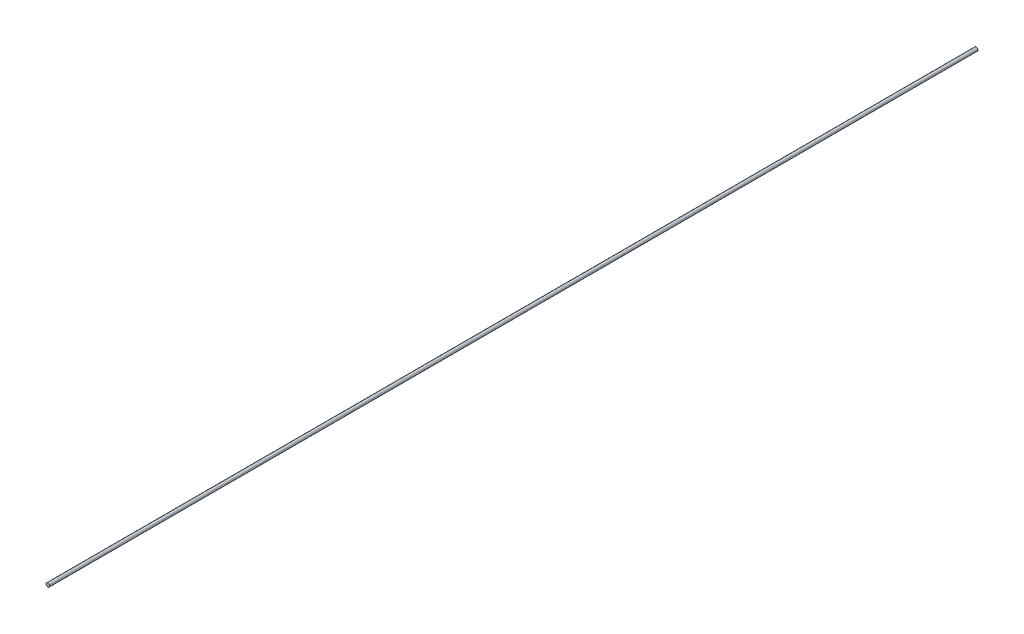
from build123d import *

# Parameters (mm, degrees)
SKETCH2_R = 5


with BuildPart() as part:
    # Sweep1: sweep along a path in Sketch1
    with BuildLine(Plane(origin=(0, 0, 0), x_dir=(0, 0, -1), z_dir=(1, 0, 0))) as sweep1_path:
        Line((0, 0), (-2605.55, 0))
    # Sketch2 → Sweep1 (sweep)
    with BuildSketch(Plane.XY):
        Circle(SKETCH2_R)
    sweep(path=sweep1_path.line)


solid = part.part
